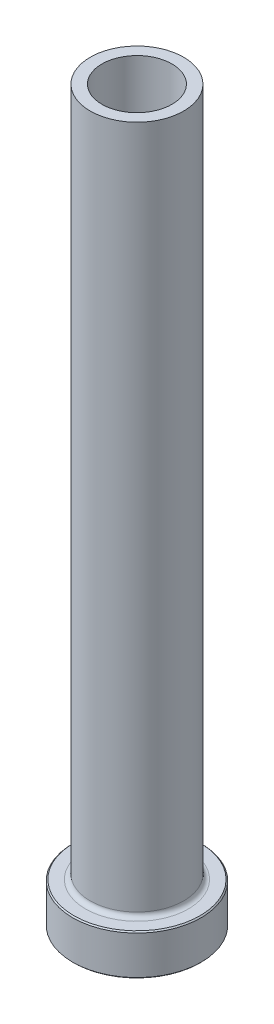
from build123d import *

# Parameters (mm, degrees)
FILLET1_R     = 0.8
CHAMFER1_SIZE = 0.2
CHAMFER3_SIZE = 0.5


with BuildPart() as part:
    # Sketch1 → Revolve1 (revolve)
    with BuildSketch(Plane.XY, mode=Mode.PRIVATE) as revolve1_sk:
        Polygon((-6, 125), (-8, 125), (-8, 7), (-11, 7), (-11, 0), (-6.25, 0), (-6.25, 58), (-6, 70), align=None)
    revolve(revolve1_sk.sketch.rotate(Axis((0, 92.187680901, 0), (0, -1, 0)), 270), axis=Axis((0, 92.187680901, 0), (0, -1, 0)))

    # Fillet1
    fillet1_edges = [part.edges().sort_by_distance(p)[0] for p in [
        (0, 7, -8),
    ]]
    fillet(fillet1_edges, radius=FILLET1_R)

    # Chamfer1
    chamfer1_edges = [part.edges().sort_by_distance(p)[0] for p in [
        (0, 0, -11),
        (0, 7, -11),
    ]]
    chamfer(chamfer1_edges, length=CHAMFER1_SIZE)

    # Chamfer3
    chamfer3_edges = [part.edges().sort_by_distance(p)[0] for p in [
        (0, 0, -6.25),
    ]]
    chamfer(chamfer3_edges, length=CHAMFER3_SIZE)


solid = part.part
